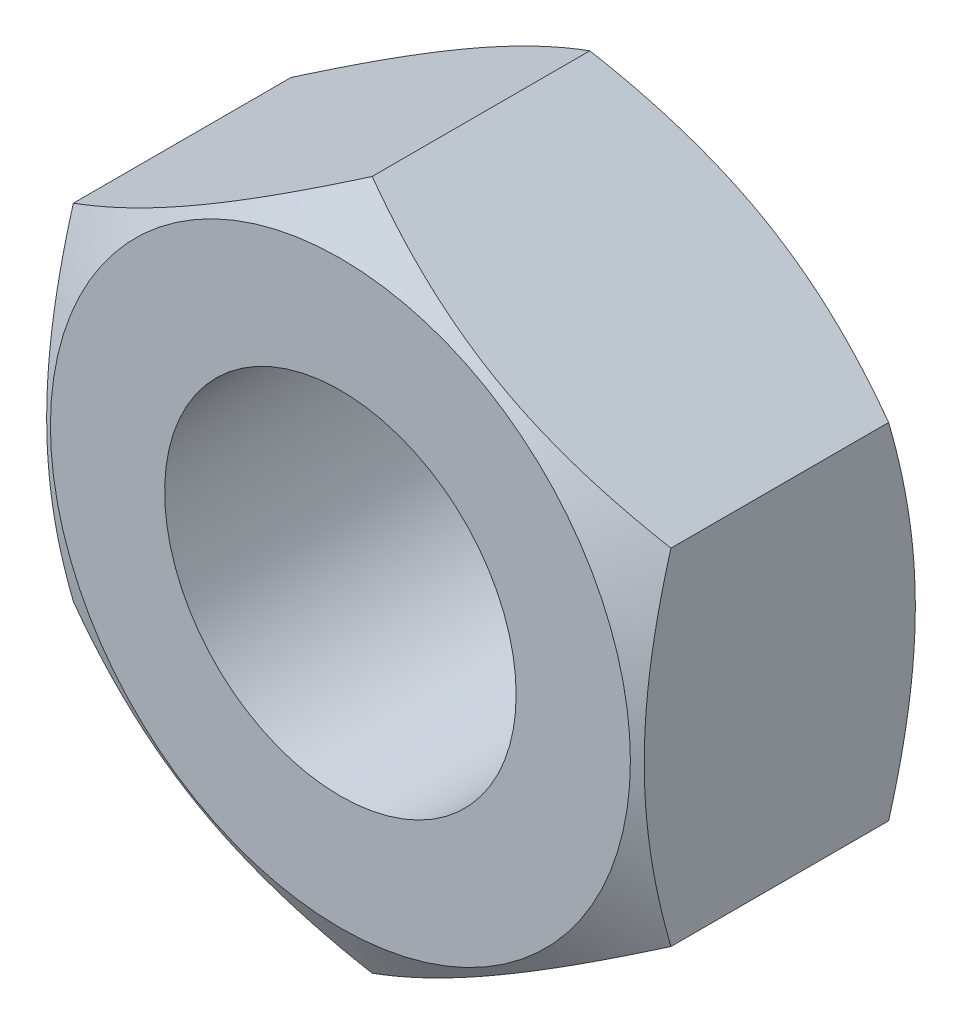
ISO-10303-21;
HEADER;
FILE_DESCRIPTION(('STEP AP214'),'2;1');
FILE_NAME('part.step','',(''),(''),'','','');
FILE_SCHEMA(('AUTOMOTIVE_DESIGN { 1 0 10303 214 1 1 1 1 }'));
ENDSEC;
DATA;
#1=APPLICATION_CONTEXT('core data for automotive mechanical design processes');
#2=APPLICATION_PROTOCOL_DEFINITION('international standard','automotive_design',2000,#1);
#3=PRODUCT_CONTEXT('',#1,'mechanical');
#4=PRODUCT('Part','Part','',(#3));
#5=PRODUCT_RELATED_PRODUCT_CATEGORY('part','',(#4));
#6=PRODUCT_DEFINITION_FORMATION('','',#4);
#7=PRODUCT_DEFINITION_CONTEXT('part definition',#1,'design');
#8=PRODUCT_DEFINITION('design','',#6,#7);
#9=PRODUCT_DEFINITION_SHAPE('','',#8);
#10=(LENGTH_UNIT() NAMED_UNIT(*) SI_UNIT(.MILLI.,.METRE.));
#11=(NAMED_UNIT(*) PLANE_ANGLE_UNIT() SI_UNIT($,.RADIAN.));
#12=(NAMED_UNIT(*) SI_UNIT($,.STERADIAN.) SOLID_ANGLE_UNIT());
#13=UNCERTAINTY_MEASURE_WITH_UNIT(LENGTH_MEASURE(1.E-05),#10,'distance_accuracy_value','');
#14=(GEOMETRIC_REPRESENTATION_CONTEXT(3) GLOBAL_UNCERTAINTY_ASSIGNED_CONTEXT((#13)) GLOBAL_UNIT_ASSIGNED_CONTEXT((#10,
#11,#12)) REPRESENTATION_CONTEXT('',''));
#15=CARTESIAN_POINT('',(0.,0.,0.));
#16=DIRECTION('',(0.,0.,1.));
#17=DIRECTION('',(1.,0.,0.));
#18=AXIS2_PLACEMENT_3D('',#15,#16,#17);
#19=CARTESIAN_POINT('',(-8.5,-4.90747728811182,8.));
#20=DIRECTION('',(-1.,0.,0.));
#21=DIRECTION('',(0.,0.,1.));
#22=AXIS2_PLACEMENT_3D('',#19,#20,#21);
#23=PLANE('',#22);
#24=DIRECTION('',(0.,0.,-1.));
#25=VECTOR('',#24,1.);
#26=CARTESIAN_POINT('',(-8.5,-4.90747728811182,8.));
#27=LINE('',#26,#25);
#28=CARTESIAN_POINT('',(-8.5,-4.90747728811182,7.09647305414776));
#29=VERTEX_POINT('',#28);
#30=CARTESIAN_POINT('',(-8.5,-4.90747728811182,0.903526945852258));
#31=VERTEX_POINT('',#30);
#32=EDGE_CURVE('E9',#29,#31,#27,.T.);
#33=ORIENTED_EDGE('',*,*,#32,.F.);
#34=CARTESIAN_POINT('',(-8.5,-13.0915549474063,3.75131765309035));
#35=CARTESIAN_POINT('',(-8.5,-12.7210522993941,3.93067870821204));
#36=CARTESIAN_POINT('',(-8.5,-12.3496893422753,4.1082935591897));
#37=CARTESIAN_POINT('',(-8.5,-11.6047849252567,4.45904687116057));
#38=CARTESIAN_POINT('',(-8.5,-11.2312431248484,4.63218460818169));
#39=CARTESIAN_POINT('',(-8.5,-10.4795547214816,4.97389023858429));
#40=CARTESIAN_POINT('',(-8.5,-10.1013940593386,5.14242731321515));
#41=CARTESIAN_POINT('',(-8.5,-9.34203313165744,5.47248218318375));
#42=CARTESIAN_POINT('',(-8.5,-8.9608330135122,5.63400031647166));
#43=CARTESIAN_POINT('',(-8.5,-8.18283943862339,5.9530606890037));
#44=CARTESIAN_POINT('',(-8.5,-7.78593021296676,6.11032222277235));
#45=CARTESIAN_POINT('',(-8.5,-6.98743583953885,6.41272243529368));
#46=CARTESIAN_POINT('',(-8.5,-6.58585016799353,6.55785974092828));
#47=CARTESIAN_POINT('',(-8.5,-5.77814054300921,6.83213435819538));
#48=CARTESIAN_POINT('',(-8.5,-5.37202798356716,6.96130485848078));
#49=CARTESIAN_POINT('',(-8.5,-4.55399343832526,7.19944334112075));
#50=CARTESIAN_POINT('',(-8.5,-4.14207335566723,7.30841778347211));
#51=CARTESIAN_POINT('',(-8.5,-3.31438796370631,7.50029341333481));
#52=CARTESIAN_POINT('',(-8.5,-2.89865550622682,7.58333244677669));
#53=CARTESIAN_POINT('',(-8.5,-2.27134456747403,7.68479926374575));
#54=CARTESIAN_POINT('',(-8.5,-2.06160610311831,7.7147743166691));
#55=CARTESIAN_POINT('',(-8.5,-1.64111774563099,7.76643728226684));
#56=CARTESIAN_POINT('',(-8.5,-1.43036795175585,7.78812599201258));
#57=CARTESIAN_POINT('',(-8.5,-1.01085234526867,7.82251681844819));
#58=CARTESIAN_POINT('',(-8.5,-0.802095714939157,7.83533052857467));
#59=CARTESIAN_POINT('',(-8.5,-0.384227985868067,7.85212506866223));
#60=CARTESIAN_POINT('',(-8.5,-0.175116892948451,7.85610604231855));
#61=CARTESIAN_POINT('',(-8.5,0.243087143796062,7.85514037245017));
#62=CARTESIAN_POINT('',(-8.5,0.452180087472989,7.8501936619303));
#63=CARTESIAN_POINT('',(-8.5,0.869974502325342,7.8314917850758));
#64=CARTESIAN_POINT('',(-8.5,1.07867595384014,7.81773618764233));
#65=CARTESIAN_POINT('',(-8.5,1.5830262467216,7.77413845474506));
#66=CARTESIAN_POINT('',(-8.5,1.87830686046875,7.73996282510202));
#67=CARTESIAN_POINT('',(-8.5,2.46661820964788,7.65586131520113));
#68=CARTESIAN_POINT('',(-8.5,2.75964862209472,7.60593321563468));
#69=CARTESIAN_POINT('',(-8.5,3.34320037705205,7.49210307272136));
#70=CARTESIAN_POINT('',(-8.5,3.63371951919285,7.42818985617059));
#71=CARTESIAN_POINT('',(-8.5,4.21181524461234,7.2883344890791));
#72=CARTESIAN_POINT('',(-8.5,4.49939187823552,7.21239254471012));
#73=CARTESIAN_POINT('',(-8.5,5.07786906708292,7.04854333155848));
#74=CARTESIAN_POINT('',(-8.5,5.36870556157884,6.9604114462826));
#75=CARTESIAN_POINT('',(-8.5,5.94751266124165,6.77523902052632));
#76=CARTESIAN_POINT('',(-8.5,6.23548324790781,6.6781984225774));
#77=CARTESIAN_POINT('',(-8.5,6.80870426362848,6.47673202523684));
#78=CARTESIAN_POINT('',(-8.5,7.09395560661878,6.37230881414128));
#79=CARTESIAN_POINT('',(-8.5,7.66210792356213,6.15728629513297));
#80=CARTESIAN_POINT('',(-8.5,7.94500892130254,6.0466870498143));
#81=CARTESIAN_POINT('',(-8.5,8.59684880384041,5.7849583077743));
#82=CARTESIAN_POINT('',(-8.5,8.9650387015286,5.63196657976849));
#83=CARTESIAN_POINT('',(-8.5,9.69841979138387,5.31893770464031));
#84=CARTESIAN_POINT('',(-8.5,10.0636108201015,5.15890017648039));
#85=CARTESIAN_POINT('',(-8.5,10.7915324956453,4.83314821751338));
#86=CARTESIAN_POINT('',(-8.5,11.1542626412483,4.66743266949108));
#87=CARTESIAN_POINT('',(-8.5,11.8775879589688,4.33143376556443));
#88=CARTESIAN_POINT('',(-8.5,12.2381831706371,4.16115049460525));
#89=CARTESIAN_POINT('',(-8.5,12.9579418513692,3.81667492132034));
#90=CARTESIAN_POINT('',(-8.5,13.317103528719,3.64247888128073));
#91=CARTESIAN_POINT('',(-8.5,14.0339093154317,3.29098919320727));
#92=CARTESIAN_POINT('',(-8.5,14.3915534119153,3.11369551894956));
#93=CARTESIAN_POINT('',(-8.5,15.4624766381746,2.57801179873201));
#94=CARTESIAN_POINT('',(-8.5,16.1738327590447,2.21577754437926));
#95=CARTESIAN_POINT('',(-8.5,17.5359107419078,1.5133609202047));
#96=CARTESIAN_POINT('',(-8.5,18.1869224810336,1.17373822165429));
#97=CARTESIAN_POINT('',(-8.5,19.486513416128,0.489824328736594));
#98=CARTESIAN_POINT('',(-8.5,20.1350925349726,0.145532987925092));
#99=CARTESIAN_POINT('',(-8.5,21.4288467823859,-0.545823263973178));
#100=CARTESIAN_POINT('',(-8.5,22.0740263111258,-0.892879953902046));
#101=CARTESIAN_POINT('',(-8.5,23.3628204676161,-1.58980967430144));
#102=CARTESIAN_POINT('',(-8.5,24.0064351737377,-1.93968255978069));
#103=CARTESIAN_POINT('',(-8.5,24.6494692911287,-2.2906121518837));
#104=B_SPLINE_CURVE_WITH_KNOTS('',3,(#34,#35,#36,#37,#38,#39,#40,#41,#42,#43,#44,#45,#46,#47,
#48,#49,#50,#51,#52,#53,#54,#55,#56,#57,#58,#59,#60,#61,#62,#63,#64,#65,#66,#67,#68,#69,#70,#71,
#72,#73,#74,#75,#76,#77,#78,#79,#80,#81,#82,#83,#84,#85,#86,#87,#88,#89,#90,#91,#92,#93,#94,#95,
#96,#97,#98,#99,#100,#101,#102,#103),.UNSPECIFIED.,.F.,.F.,(4,2,2,2,2,2,2,2,2,2,2,2,2,2,2,2,2,2,
2,2,2,2,2,2,2,2,2,2,2,2,2,2,2,2,4),(0.,1.23491770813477,2.47003387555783,3.71202833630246,
4.9539629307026,6.2345954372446,7.51537278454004,8.7934414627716,10.0711006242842,
11.3418487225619,11.9773195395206,12.6127292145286,13.2399967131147,13.867254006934,
14.4945160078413,15.121808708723,16.0130688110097,16.904454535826,17.7965550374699,
18.6886402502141,19.6001588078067,20.5116832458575,21.4228896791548,22.3340868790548,
23.5301212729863,24.7262204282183,25.9225562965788,27.1188699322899,28.3163795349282,
29.5138992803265,31.9086521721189,34.1114570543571,36.3143311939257,38.5121282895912,
40.7098129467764),.UNSPECIFIED.);
#105=CARTESIAN_POINT('',(-8.5,4.90747728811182,7.09647305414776));
#106=VERTEX_POINT('',#105);
#107=EDGE_CURVE('E69',#29,#106,#104,.T.);
#108=ORIENTED_EDGE('',*,*,#107,.T.);
#109=DIRECTION('',(0.,0.,-1.));
#110=VECTOR('',#109,1.);
#111=CARTESIAN_POINT('',(-8.5,4.90747728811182,8.));
#112=LINE('',#111,#110);
#113=CARTESIAN_POINT('',(-8.5,4.90747728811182,0.903526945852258));
#114=VERTEX_POINT('',#113);
#115=EDGE_CURVE('E38',#106,#114,#112,.T.);
#116=ORIENTED_EDGE('',*,*,#115,.T.);
#117=CARTESIAN_POINT('',(-8.5,-13.217348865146,4.30968253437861));
#118=CARTESIAN_POINT('',(-8.5,-12.8458016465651,4.1293073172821));
#119=CARTESIAN_POINT('',(-8.5,-12.4734053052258,3.95065142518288));
#120=CARTESIAN_POINT('',(-8.5,-11.7264629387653,3.59774455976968));
#121=CARTESIAN_POINT('',(-8.5,-11.3519165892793,3.42349427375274));
#122=CARTESIAN_POINT('',(-8.5,-10.598309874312,3.07949578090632));
#123=CARTESIAN_POINT('',(-8.5,-10.2192360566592,2.90977694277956));
#124=CARTESIAN_POINT('',(-8.5,-9.45808580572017,2.57723767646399));
#125=CARTESIAN_POINT('',(-8.5,-9.07600951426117,2.41441692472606));
#126=CARTESIAN_POINT('',(-8.5,-8.29577621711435,2.09234631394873));
#127=CARTESIAN_POINT('',(-8.5,-7.89749985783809,1.93338400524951));
#128=CARTESIAN_POINT('',(-8.5,-7.09630157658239,1.62740499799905));
#129=CARTESIAN_POINT('',(-8.5,-6.69337914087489,1.48038963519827));
#130=CARTESIAN_POINT('',(-8.5,-5.88298561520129,1.20213853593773));
#131=CARTESIAN_POINT('',(-8.5,-5.47552550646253,1.07087115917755));
#132=CARTESIAN_POINT('',(-8.5,-4.65477495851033,0.828303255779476));
#133=CARTESIAN_POINT('',(-8.5,-4.24148638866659,0.716996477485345));
#134=CARTESIAN_POINT('',(-8.5,-3.4110781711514,0.520269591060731));
#135=CARTESIAN_POINT('',(-8.5,-2.99399303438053,0.434707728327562));
#136=CARTESIAN_POINT('',(-8.5,-2.36453907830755,0.329359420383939));
#137=CARTESIAN_POINT('',(-8.5,-2.15406819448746,0.298074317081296));
#138=CARTESIAN_POINT('',(-8.5,-1.7320683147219,0.243781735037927));
#139=CARTESIAN_POINT('',(-8.5,-1.52053942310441,0.220773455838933));
#140=CARTESIAN_POINT('',(-8.5,-1.09948590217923,0.183783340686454));
#141=CARTESIAN_POINT('',(-8.5,-0.889971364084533,0.169687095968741));
#142=CARTESIAN_POINT('',(-8.5,-0.470533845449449,0.150369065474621));
#143=CARTESIAN_POINT('',(-8.5,-0.260610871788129,0.145147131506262));
#144=CARTESIAN_POINT('',(-8.5,0.159267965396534,0.143702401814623));
#145=CARTESIAN_POINT('',(-8.5,0.369223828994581,0.147479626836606));
#146=CARTESIAN_POINT('',(-8.5,0.788788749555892,0.163940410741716));
#147=CARTESIAN_POINT('',(-8.5,0.998397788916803,0.176624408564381));
#148=CARTESIAN_POINT('',(-8.5,1.50108256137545,0.217454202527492));
#149=CARTESIAN_POINT('',(-8.5,1.793827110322,0.249766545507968));
#150=CARTESIAN_POINT('',(-8.5,2.37715285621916,0.330009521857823));
#151=CARTESIAN_POINT('',(-8.5,2.66773375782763,0.377942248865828));
#152=CARTESIAN_POINT('',(-8.5,3.53589346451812,0.542630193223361));
#153=CARTESIAN_POINT('',(-8.5,4.10956801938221,0.680245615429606));
#154=CARTESIAN_POINT('',(-8.5,4.96741250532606,0.919010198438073));
#155=CARTESIAN_POINT('',(-8.5,5.25602859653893,1.00510487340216));
#156=CARTESIAN_POINT('',(-8.5,5.83045786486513,1.18626877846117));
#157=CARTESIAN_POINT('',(-8.5,6.11627102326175,1.28133806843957));
#158=CARTESIAN_POINT('',(-8.5,6.68518369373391,1.47892313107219));
#159=CARTESIAN_POINT('',(-8.5,6.96828405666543,1.58143647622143));
#160=CARTESIAN_POINT('',(-8.5,7.53213698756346,1.79270023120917));
#161=CARTESIAN_POINT('',(-8.5,7.81288958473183,1.90145056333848));
#162=CARTESIAN_POINT('',(-8.5,8.48212780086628,2.1678721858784));
#163=CARTESIAN_POINT('',(-8.5,8.86963833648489,2.32798850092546));
#164=CARTESIAN_POINT('',(-8.5,9.64130597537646,2.65613130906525));
#165=CARTESIAN_POINT('',(-8.5,10.0254628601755,2.82415831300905));
#166=CARTESIAN_POINT('',(-8.5,10.7910586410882,3.16651606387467));
#167=CARTESIAN_POINT('',(-8.5,11.172496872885,3.34084829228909));
#168=CARTESIAN_POINT('',(-8.5,11.9330253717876,3.69452635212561));
#169=CARTESIAN_POINT('',(-8.5,12.3121156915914,3.87387207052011));
#170=CARTESIAN_POINT('',(-8.5,13.0687747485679,4.23683235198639));
#171=CARTESIAN_POINT('',(-8.5,13.4463412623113,4.42045154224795));
#172=CARTESIAN_POINT('',(-8.5,14.1998317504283,4.7910284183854));
#173=CARTESIAN_POINT('',(-8.5,14.5757557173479,4.9779861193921));
#174=CARTESIAN_POINT('',(-8.5,15.7013597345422,5.54291756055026));
#175=CARTESIAN_POINT('',(-8.5,16.448977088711,5.92500052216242));
#176=CARTESIAN_POINT('',(-8.5,17.8763952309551,6.6637998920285));
#177=CARTESIAN_POINT('',(-8.5,18.5565227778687,7.01988783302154));
#178=CARTESIAN_POINT('',(-8.5,19.9142584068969,7.73689269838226));
#179=CARTESIAN_POINT('',(-8.5,20.5918663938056,8.09780980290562));
#180=CARTESIAN_POINT('',(-8.5,21.9433746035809,8.82237697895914));
#181=CARTESIAN_POINT('',(-8.5,22.6172798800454,9.18601763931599));
#182=CARTESIAN_POINT('',(-8.5,23.963483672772,9.91617087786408));
#183=CARTESIAN_POINT('',(-8.5,24.6357822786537,10.2826832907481));
#184=CARTESIAN_POINT('',(-8.5,25.3074917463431,10.6502650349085));
#185=B_SPLINE_CURVE_WITH_KNOTS('',3,(#117,#118,#119,#120,#121,#122,#123,#124,#125,#126,#127,
#128,#129,#130,#131,#132,#133,#134,#135,#136,#137,#138,#139,#140,#141,#142,#143,#144,#145,#146,
#147,#148,#149,#150,#151,#152,#153,#154,#155,#156,#157,#158,#159,#160,#161,#162,#163,#164,#165,
#166,#167,#168,#169,#170,#171,#172,#173,#174,#175,#176,#177,#178,#179,#180,#181,#182,#183,#184),
.UNSPECIFIED.,.F.,.F.,(4,2,2,2,2,2,2,2,2,2,2,2,2,2,2,2,2,2,2,2,2,2,2,2,2,2,2,2,2,2,2,2,2,4),(0.,
1.23906418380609,2.47832048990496,3.7242641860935,4.97014937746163,6.25648329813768,
7.54296084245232,8.82680874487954,10.1102538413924,11.3864970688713,12.0247099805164,
12.6628611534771,13.2926441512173,13.9224166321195,14.5521905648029,15.1819955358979,
16.0650645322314,16.9482519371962,18.7155902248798,19.6190649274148,20.5225456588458,
21.4257330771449,22.3289092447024,23.5866510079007,24.8444741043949,26.1025946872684,
27.3606869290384,28.6202113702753,29.8797415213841,32.3984513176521,34.7015479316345,
37.0047307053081,39.3019924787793,41.599122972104),.UNSPECIFIED.);
#186=EDGE_CURVE('E89',#31,#114,#185,.T.);
#187=ORIENTED_EDGE('',*,*,#186,.F.);
#188=EDGE_LOOP('',(#33,#108,#116,#187));
#189=FACE_BOUND('',#188,.T.);
#190=ADVANCED_FACE('F14',(#189),#23,.T.);
#191=CARTESIAN_POINT('',(-8.5,-4.90747728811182,8.));
#192=DIRECTION('',(0.5,0.866025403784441,0.));
#193=DIRECTION('',(-0.866025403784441,0.5,0.));
#194=AXIS2_PLACEMENT_3D('',#191,#192,#193);
#195=PLANE('',#194);
#196=CARTESIAN_POINT('',(-8.5002,-4.90736181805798,7.09640638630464));
#197=CARTESIAN_POINT('',(-8.31336077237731,-5.01523349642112,7.15867629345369));
#198=CARTESIAN_POINT('',(-8.1258249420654,-5.1235073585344,7.21812013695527));
#199=CARTESIAN_POINT('',(-7.74923024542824,-5.34093440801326,7.33057732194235));
#200=CARTESIAN_POINT('',(-7.56017075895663,-5.45008795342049,7.38358788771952));
#201=CARTESIAN_POINT('',(-6.9899652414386,-5.77929626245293,7.53192904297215));
#202=CARTESIAN_POINT('',(-6.60656835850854,-6.00065055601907,7.61630350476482));
#203=CARTESIAN_POINT('',(-6.03282233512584,-6.33190297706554,7.71524241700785));
#204=CARTESIAN_POINT('',(-5.84418723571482,-6.44081150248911,7.7434272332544));
#205=CARTESIAN_POINT('',(-5.46606397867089,-6.65912106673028,7.7906883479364));
#206=CARTESIAN_POINT('',(-5.27657589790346,-6.76852206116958,7.80976545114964));
#207=CARTESIAN_POINT('',(-4.8972734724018,-6.98751241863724,7.8383276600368));
#208=CARTESIAN_POINT('',(-4.70745974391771,-7.09710142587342,7.84782365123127));
#209=CARTESIAN_POINT('',(-4.32765694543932,-7.31638067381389,7.85702005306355));
#210=CARTESIAN_POINT('',(-4.13766788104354,-7.42607091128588,7.85672076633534));
#211=CARTESIAN_POINT('',(-3.78247698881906,-7.63114046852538,7.8470079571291));
#212=CARTESIAN_POINT('',(-3.6172500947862,-7.72653426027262,7.83877926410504));
#213=CARTESIAN_POINT('',(-3.28718328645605,-7.91709842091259,7.81507319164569));
#214=CARTESIAN_POINT('',(-3.12234339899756,-8.01226877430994,7.7995953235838));
#215=CARTESIAN_POINT('',(-2.62846189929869,-8.29741139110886,7.74265381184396));
#216=CARTESIAN_POINT('',(-2.30029449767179,-8.48687892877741,7.69068937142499));
#217=CARTESIAN_POINT('',(-1.64047857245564,-8.86782383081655,7.56077749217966));
#218=CARTESIAN_POINT('',(-1.30891425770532,-9.05925257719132,7.48227936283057));
#219=CARTESIAN_POINT('',(-0.650730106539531,-9.43925537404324,7.30412109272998));
#220=CARTESIAN_POINT('',(-0.324101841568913,-9.62783429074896,7.20450279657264));
#221=CARTESIAN_POINT('',(0.000200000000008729,-9.81507004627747,7.09640638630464));
#222=B_SPLINE_CURVE_WITH_KNOTS('',3,(#196,#197,#198,#199,#200,#201,#202,#203,#204,#205,#206,
#207,#208,#209,#210,#211,#212,#213,#214,#215,#216,#217,#218,#219,#220,#221),.UNSPECIFIED.,.F.,
.F.,(4,2,2,2,2,2,2,2,2,2,2,2,4),(0.,0.673596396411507,1.34748239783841,2.69805431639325,
3.35679995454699,4.01548737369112,4.67342558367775,5.33134346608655,5.90409556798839,
6.47688628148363,7.62328361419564,8.79510569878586,9.9646274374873),.UNSPECIFIED.);
#223=CARTESIAN_POINT('',(0.,-9.81495457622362,7.09647305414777));
#224=VERTEX_POINT('',#223);
#225=EDGE_CURVE('E77',#29,#224,#222,.T.);
#226=ORIENTED_EDGE('',*,*,#225,.F.);
#227=ORIENTED_EDGE('',*,*,#32,.T.);
#228=CARTESIAN_POINT('',(-8.5002,-4.90736181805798,0.90359361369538));
#229=CARTESIAN_POINT('',(-8.31336077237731,-5.01523349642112,0.841323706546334));
#230=CARTESIAN_POINT('',(-8.1258249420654,-5.1235073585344,0.781879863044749));
#231=CARTESIAN_POINT('',(-7.74923024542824,-5.34093440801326,0.669422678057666));
#232=CARTESIAN_POINT('',(-7.56017075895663,-5.45008795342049,0.616412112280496));
#233=CARTESIAN_POINT('',(-6.9899652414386,-5.77929626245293,0.468070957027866));
#234=CARTESIAN_POINT('',(-6.60656835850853,-6.00065055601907,0.383696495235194));
#235=CARTESIAN_POINT('',(-6.03282233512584,-6.33190297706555,0.284757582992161));
#236=CARTESIAN_POINT('',(-5.84418723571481,-6.44081150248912,0.256572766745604));
#237=CARTESIAN_POINT('',(-5.46606397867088,-6.65912106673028,0.209311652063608));
#238=CARTESIAN_POINT('',(-5.27657589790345,-6.76852206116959,0.190234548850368));
#239=CARTESIAN_POINT('',(-4.89727347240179,-6.98751241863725,0.161672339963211));
#240=CARTESIAN_POINT('',(-4.7074597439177,-7.09710142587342,0.15217634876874));
#241=CARTESIAN_POINT('',(-4.32765694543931,-7.3163806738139,0.14297994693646));
#242=CARTESIAN_POINT('',(-4.13766788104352,-7.42607091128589,0.143279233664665));
#243=CARTESIAN_POINT('',(-3.78247698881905,-7.63114046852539,0.15299204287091));
#244=CARTESIAN_POINT('',(-3.6172500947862,-7.72653426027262,0.161220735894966));
#245=CARTESIAN_POINT('',(-3.28718328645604,-7.9170984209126,0.184926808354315));
#246=CARTESIAN_POINT('',(-3.12234339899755,-8.01226877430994,0.200404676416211));
#247=CARTESIAN_POINT('',(-2.62846189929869,-8.29741139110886,0.257346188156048));
#248=CARTESIAN_POINT('',(-2.30029449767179,-8.48687892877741,0.309310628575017));
#249=CARTESIAN_POINT('',(-1.64047857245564,-8.86782383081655,0.439222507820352));
#250=CARTESIAN_POINT('',(-1.30891425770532,-9.05925257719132,0.517720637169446));
#251=CARTESIAN_POINT('',(-0.650730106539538,-9.43925537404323,0.695878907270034));
#252=CARTESIAN_POINT('',(-0.324101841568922,-9.62783429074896,0.79549720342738));
#253=CARTESIAN_POINT('',(0.000199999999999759,-9.81507004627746,0.903593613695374));
#254=B_SPLINE_CURVE_WITH_KNOTS('',3,(#228,#229,#230,#231,#232,#233,#234,#235,#236,#237,#238,
#239,#240,#241,#242,#243,#244,#245,#246,#247,#248,#249,#250,#251,#252,#253),.UNSPECIFIED.,.F.,
.F.,(4,2,2,2,2,2,2,2,2,2,2,2,4),(0.,0.673596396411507,1.34748239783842,2.69805431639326,
3.356799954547,4.01548737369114,4.67342558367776,5.33134346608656,5.9040955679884,
6.47688628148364,7.62328361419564,8.79510569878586,9.96462743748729),.UNSPECIFIED.);
#255=CARTESIAN_POINT('',(0.,-9.81495457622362,0.903526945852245));
#256=VERTEX_POINT('',#255);
#257=EDGE_CURVE('E111',#31,#256,#254,.T.);
#258=ORIENTED_EDGE('',*,*,#257,.T.);
#259=DIRECTION('',(0.,0.,-1.));
#260=VECTOR('',#259,1.);
#261=CARTESIAN_POINT('',(0.,-9.81495457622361,8.));
#262=LINE('',#261,#260);
#263=EDGE_CURVE('E23',#224,#256,#262,.T.);
#264=ORIENTED_EDGE('',*,*,#263,.F.);
#265=EDGE_LOOP('',(#226,#227,#258,#264));
#266=FACE_BOUND('',#265,.T.);
#267=ADVANCED_FACE('F16',(#266),#195,.F.);
#268=CARTESIAN_POINT('',(8.5,-4.90747728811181,8.));
#269=DIRECTION('',(0.5,-0.86602540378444,0.));
#270=DIRECTION('',(0.86602540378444,0.5,0.));
#271=AXIS2_PLACEMENT_3D('',#268,#269,#270);
#272=PLANE('',#271);
#273=DIRECTION('',(0.,0.,-1.));
#274=VECTOR('',#273,1.);
#275=CARTESIAN_POINT('',(8.5,-4.90747728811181,8.));
#276=LINE('',#275,#274);
#277=CARTESIAN_POINT('',(8.5,-4.90747728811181,7.09647305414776));
#278=VERTEX_POINT('',#277);
#279=CARTESIAN_POINT('',(8.5,-4.90747728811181,0.903526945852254));
#280=VERTEX_POINT('',#279);
#281=EDGE_CURVE('E94',#278,#280,#276,.T.);
#282=ORIENTED_EDGE('',*,*,#281,.F.);
#283=CARTESIAN_POINT('',(8.5002,-4.90736181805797,7.09640638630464));
#284=CARTESIAN_POINT('',(8.31336077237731,-5.01523349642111,7.15867629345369));
#285=CARTESIAN_POINT('',(8.1258249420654,-5.12350735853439,7.21812013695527));
#286=CARTESIAN_POINT('',(7.74923024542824,-5.34093440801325,7.33057732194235));
#287=CARTESIAN_POINT('',(7.56017075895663,-5.45008795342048,7.38358788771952));
#288=CARTESIAN_POINT('',(6.9899652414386,-5.77929626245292,7.53192904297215));
#289=CARTESIAN_POINT('',(6.60656835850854,-6.00065055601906,7.61630350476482));
#290=CARTESIAN_POINT('',(6.03282233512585,-6.33190297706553,7.71524241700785));
#291=CARTESIAN_POINT('',(5.84418723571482,-6.4408115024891,7.74342723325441));
#292=CARTESIAN_POINT('',(5.4660639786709,-6.65912106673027,7.7906883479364));
#293=CARTESIAN_POINT('',(5.27657589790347,-6.76852206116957,7.80976545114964));
#294=CARTESIAN_POINT('',(4.89727347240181,-6.98751241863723,7.8383276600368));
#295=CARTESIAN_POINT('',(4.70745974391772,-7.09710142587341,7.84782365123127));
#296=CARTESIAN_POINT('',(4.32765694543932,-7.31638067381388,7.85702005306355));
#297=CARTESIAN_POINT('',(4.13766788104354,-7.42607091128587,7.85672076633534));
#298=CARTESIAN_POINT('',(3.78247698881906,-7.63114046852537,7.8470079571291));
#299=CARTESIAN_POINT('',(3.61725009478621,-7.72653426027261,7.83877926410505));
#300=CARTESIAN_POINT('',(3.28718328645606,-7.91709842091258,7.8150731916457));
#301=CARTESIAN_POINT('',(3.12234339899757,-8.01226877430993,7.7995953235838));
#302=CARTESIAN_POINT('',(2.6284618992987,-8.29741139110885,7.74265381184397));
#303=CARTESIAN_POINT('',(2.3002944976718,-8.4868789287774,7.690689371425));
#304=CARTESIAN_POINT('',(1.64047857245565,-8.86782383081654,7.56077749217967));
#305=CARTESIAN_POINT('',(1.30891425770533,-9.05925257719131,7.48227936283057));
#306=CARTESIAN_POINT('',(0.650730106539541,-9.43925537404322,7.30412109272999));
#307=CARTESIAN_POINT('',(0.324101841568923,-9.62783429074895,7.20450279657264));
#308=CARTESIAN_POINT('',(-0.000199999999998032,-9.81507004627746,7.09640638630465));
#309=B_SPLINE_CURVE_WITH_KNOTS('',3,(#283,#284,#285,#286,#287,#288,#289,#290,#291,#292,#293,
#294,#295,#296,#297,#298,#299,#300,#301,#302,#303,#304,#305,#306,#307,#308),.UNSPECIFIED.,.F.,
.F.,(4,2,2,2,2,2,2,2,2,2,2,2,4),(0.,0.673596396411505,1.34748239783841,2.69805431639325,
3.35679995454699,4.01548737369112,4.67342558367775,5.33134346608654,5.90409556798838,
6.47688628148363,7.62328361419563,8.79510569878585,9.96462743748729),.UNSPECIFIED.);
#310=EDGE_CURVE('E103',#278,#224,#309,.T.);
#311=ORIENTED_EDGE('',*,*,#310,.T.);
#312=ORIENTED_EDGE('',*,*,#263,.T.);
#313=CARTESIAN_POINT('',(8.5002,-4.90736181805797,0.903593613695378));
#314=CARTESIAN_POINT('',(8.31336077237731,-5.01523349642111,0.841323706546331));
#315=CARTESIAN_POINT('',(8.1258249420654,-5.12350735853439,0.781879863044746));
#316=CARTESIAN_POINT('',(7.74923024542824,-5.34093440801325,0.669422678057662));
#317=CARTESIAN_POINT('',(7.56017075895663,-5.45008795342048,0.616412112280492));
#318=CARTESIAN_POINT('',(6.9899652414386,-5.77929626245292,0.468070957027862));
#319=CARTESIAN_POINT('',(6.60656835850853,-6.00065055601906,0.38369649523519));
#320=CARTESIAN_POINT('',(6.03282233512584,-6.33190297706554,0.284757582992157));
#321=CARTESIAN_POINT('',(5.84418723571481,-6.44081150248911,0.2565727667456));
#322=CARTESIAN_POINT('',(5.46606397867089,-6.65912106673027,0.209311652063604));
#323=CARTESIAN_POINT('',(5.27657589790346,-6.76852206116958,0.190234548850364));
#324=CARTESIAN_POINT('',(4.8972734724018,-6.98751241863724,0.161672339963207));
#325=CARTESIAN_POINT('',(4.7074597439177,-7.09710142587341,0.152176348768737));
#326=CARTESIAN_POINT('',(4.32765694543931,-7.31638067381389,0.142979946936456));
#327=CARTESIAN_POINT('',(4.13766788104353,-7.42607091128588,0.143279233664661));
#328=CARTESIAN_POINT('',(3.78247698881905,-7.63114046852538,0.152992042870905));
#329=CARTESIAN_POINT('',(3.6172500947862,-7.72653426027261,0.161220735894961));
#330=CARTESIAN_POINT('',(3.28718328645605,-7.91709842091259,0.18492680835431));
#331=CARTESIAN_POINT('',(3.12234339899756,-8.01226877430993,0.200404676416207));
#332=CARTESIAN_POINT('',(2.62846189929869,-8.29741139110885,0.257346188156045));
#333=CARTESIAN_POINT('',(2.30029449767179,-8.4868789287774,0.309310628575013));
#334=CARTESIAN_POINT('',(1.64047857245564,-8.86782383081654,0.439222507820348));
#335=CARTESIAN_POINT('',(1.30891425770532,-9.05925257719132,0.517720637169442));
#336=CARTESIAN_POINT('',(0.650730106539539,-9.43925537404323,0.695878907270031));
#337=CARTESIAN_POINT('',(0.324101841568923,-9.62783429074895,0.795497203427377));
#338=CARTESIAN_POINT('',(-0.000199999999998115,-9.81507004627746,0.903593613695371));
#339=B_SPLINE_CURVE_WITH_KNOTS('',3,(#313,#314,#315,#316,#317,#318,#319,#320,#321,#322,#323,
#324,#325,#326,#327,#328,#329,#330,#331,#332,#333,#334,#335,#336,#337,#338),.UNSPECIFIED.,.F.,
.F.,(4,2,2,2,2,2,2,2,2,2,2,2,4),(0.,0.673596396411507,1.34748239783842,2.69805431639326,
3.356799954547,4.01548737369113,4.67342558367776,5.33134346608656,5.9040955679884,
6.47688628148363,7.62328361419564,8.79510569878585,9.96462743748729),.UNSPECIFIED.);
#340=EDGE_CURVE('E102',#280,#256,#339,.T.);
#341=ORIENTED_EDGE('',*,*,#340,.F.);
#342=EDGE_LOOP('',(#282,#311,#312,#341));
#343=FACE_BOUND('',#342,.T.);
#344=ADVANCED_FACE('F101',(#343),#272,.T.);
#345=CARTESIAN_POINT('',(8.5,-4.90747728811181,8.));
#346=DIRECTION('',(-1.,0.,0.));
#347=DIRECTION('',(0.,0.,1.));
#348=AXIS2_PLACEMENT_3D('',#345,#346,#347);
#349=PLANE('',#348);
#350=CARTESIAN_POINT('',(8.5,-13.0915549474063,3.75131765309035));
#351=CARTESIAN_POINT('',(8.5,-12.7210522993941,3.93067870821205));
#352=CARTESIAN_POINT('',(8.5,-12.3496893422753,4.10829355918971));
#353=CARTESIAN_POINT('',(8.5,-11.6047849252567,4.45904687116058));
#354=CARTESIAN_POINT('',(8.5,-11.2312431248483,4.63218460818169));
#355=CARTESIAN_POINT('',(8.5,-10.4795547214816,4.9738902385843));
#356=CARTESIAN_POINT('',(8.5,-10.1013940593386,5.14242731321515));
#357=CARTESIAN_POINT('',(8.5,-9.34203313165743,5.47248218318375));
#358=CARTESIAN_POINT('',(8.5,-8.96083301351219,5.63400031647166));
#359=CARTESIAN_POINT('',(8.5,-8.18283943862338,5.9530606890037));
#360=CARTESIAN_POINT('',(8.5,-7.78593021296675,6.11032222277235));
#361=CARTESIAN_POINT('',(8.5,-6.98743583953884,6.41272243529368));
#362=CARTESIAN_POINT('',(8.5,-6.58585016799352,6.55785974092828));
#363=CARTESIAN_POINT('',(8.5,-5.7781405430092,6.83213435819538));
#364=CARTESIAN_POINT('',(8.5,-5.37202798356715,6.96130485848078));
#365=CARTESIAN_POINT('',(8.5,-4.55399343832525,7.19944334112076));
#366=CARTESIAN_POINT('',(8.5,-4.14207335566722,7.30841778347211));
#367=CARTESIAN_POINT('',(8.5,-3.31438796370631,7.50029341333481));
#368=CARTESIAN_POINT('',(8.5,-2.89865550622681,7.58333244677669));
#369=CARTESIAN_POINT('',(8.5,-2.27134456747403,7.68479926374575));
#370=CARTESIAN_POINT('',(8.5,-2.0616061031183,7.7147743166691));
#371=CARTESIAN_POINT('',(8.5,-1.64111774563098,7.76643728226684));
#372=CARTESIAN_POINT('',(8.5,-1.43036795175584,7.78812599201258));
#373=CARTESIAN_POINT('',(8.5,-1.01085234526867,7.82251681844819));
#374=CARTESIAN_POINT('',(8.5,-0.802095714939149,7.83533052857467));
#375=CARTESIAN_POINT('',(8.5,-0.384227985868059,7.85212506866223));
#376=CARTESIAN_POINT('',(8.5,-0.175116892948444,7.85610604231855));
#377=CARTESIAN_POINT('',(8.5,0.243087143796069,7.85514037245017));
#378=CARTESIAN_POINT('',(8.5,0.452180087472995,7.8501936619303));
#379=CARTESIAN_POINT('',(8.5,0.869974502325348,7.8314917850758));
#380=CARTESIAN_POINT('',(8.5,1.07867595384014,7.81773618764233));
#381=CARTESIAN_POINT('',(8.5,1.58302624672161,7.77413845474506));
#382=CARTESIAN_POINT('',(8.5,1.87830686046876,7.73996282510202));
#383=CARTESIAN_POINT('',(8.5,2.46661820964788,7.65586131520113));
#384=CARTESIAN_POINT('',(8.5,2.75964862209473,7.60593321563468));
#385=CARTESIAN_POINT('',(8.5,3.34320037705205,7.49210307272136));
#386=CARTESIAN_POINT('',(8.5,3.63371951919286,7.42818985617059));
#387=CARTESIAN_POINT('',(8.5,4.21181524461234,7.2883344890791));
#388=CARTESIAN_POINT('',(8.5,4.49939187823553,7.21239254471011));
#389=CARTESIAN_POINT('',(8.5,5.07786906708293,7.04854333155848));
#390=CARTESIAN_POINT('',(8.5,5.36870556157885,6.96041144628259));
#391=CARTESIAN_POINT('',(8.5,5.94751266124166,6.77523902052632));
#392=CARTESIAN_POINT('',(8.5,6.23548324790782,6.67819842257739));
#393=CARTESIAN_POINT('',(8.5,6.80870426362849,6.47673202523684));
#394=CARTESIAN_POINT('',(8.5,7.09395560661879,6.37230881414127));
#395=CARTESIAN_POINT('',(8.5,7.66210792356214,6.15728629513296));
#396=CARTESIAN_POINT('',(8.5,7.94500892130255,6.04668704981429));
#397=CARTESIAN_POINT('',(8.5,8.59684880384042,5.78495830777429));
#398=CARTESIAN_POINT('',(8.5,8.96503870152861,5.63196657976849));
#399=CARTESIAN_POINT('',(8.5,9.69841979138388,5.31893770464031));
#400=CARTESIAN_POINT('',(8.5,10.0636108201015,5.15890017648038));
#401=CARTESIAN_POINT('',(8.5,10.7915324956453,4.83314821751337));
#402=CARTESIAN_POINT('',(8.5,11.1542626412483,4.66743266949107));
#403=CARTESIAN_POINT('',(8.5,11.8775879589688,4.33143376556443));
#404=CARTESIAN_POINT('',(8.5,12.2381831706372,4.16115049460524));
#405=CARTESIAN_POINT('',(8.5,12.9579418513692,3.81667492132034));
#406=CARTESIAN_POINT('',(8.5,13.317103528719,3.64247888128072));
#407=CARTESIAN_POINT('',(8.5,14.0339093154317,3.29098919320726));
#408=CARTESIAN_POINT('',(8.5,14.3915534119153,3.11369551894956));
#409=CARTESIAN_POINT('',(8.5,15.4624766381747,2.578011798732));
#410=CARTESIAN_POINT('',(8.5,16.1738327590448,2.21577754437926));
#411=CARTESIAN_POINT('',(8.5,17.5359107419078,1.5133609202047));
#412=CARTESIAN_POINT('',(8.5,18.1869224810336,1.17373822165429));
#413=CARTESIAN_POINT('',(8.5,19.486513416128,0.48982432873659));
#414=CARTESIAN_POINT('',(8.5,20.1350925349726,0.14553298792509));
#415=CARTESIAN_POINT('',(8.5,21.4288467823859,-0.545823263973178));
#416=CARTESIAN_POINT('',(8.5,22.0740263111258,-0.892879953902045));
#417=CARTESIAN_POINT('',(8.5,23.3628204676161,-1.58980967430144));
#418=CARTESIAN_POINT('',(8.5,24.0064351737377,-1.93968255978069));
#419=CARTESIAN_POINT('',(8.5,24.6494692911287,-2.2906121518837));
#420=B_SPLINE_CURVE_WITH_KNOTS('',3,(#350,#351,#352,#353,#354,#355,#356,#357,#358,#359,#360,
#361,#362,#363,#364,#365,#366,#367,#368,#369,#370,#371,#372,#373,#374,#375,#376,#377,#378,#379,
#380,#381,#382,#383,#384,#385,#386,#387,#388,#389,#390,#391,#392,#393,#394,#395,#396,#397,#398,
#399,#400,#401,#402,#403,#404,#405,#406,#407,#408,#409,#410,#411,#412,#413,#414,#415,#416,#417,
#418,#419),.UNSPECIFIED.,.F.,.F.,(4,2,2,2,2,2,2,2,2,2,2,2,2,2,2,2,2,2,2,2,2,2,2,2,2,2,2,2,2,2,2,
2,2,2,4),(0.,1.23491770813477,2.47003387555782,3.71202833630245,4.95396293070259,
6.23459543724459,7.51537278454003,8.79344146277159,10.0711006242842,11.3418487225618,
11.9773195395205,12.6127292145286,13.2399967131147,13.867254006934,14.4945160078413,
15.121808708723,16.0130688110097,16.904454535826,17.7965550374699,18.6886402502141,
19.6001588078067,20.5116832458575,21.4228896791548,22.3340868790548,23.5301212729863,
24.7262204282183,25.9225562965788,27.1188699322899,28.3163795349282,29.5138992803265,
31.9086521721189,34.1114570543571,36.3143311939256,38.5121282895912,40.7098129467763),.UNSPECIFIED.);
#421=CARTESIAN_POINT('',(8.5,4.90747728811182,7.09647305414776));
#422=VERTEX_POINT('',#421);
#423=EDGE_CURVE('E173',#278,#422,#420,.T.);
#424=ORIENTED_EDGE('',*,*,#423,.F.);
#425=ORIENTED_EDGE('',*,*,#281,.T.);
#426=CARTESIAN_POINT('',(8.5,-13.217348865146,4.3096825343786));
#427=CARTESIAN_POINT('',(8.5,-12.8458016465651,4.1293073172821));
#428=CARTESIAN_POINT('',(8.5,-12.4734053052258,3.95065142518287));
#429=CARTESIAN_POINT('',(8.5,-11.7264629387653,3.59774455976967));
#430=CARTESIAN_POINT('',(8.5,-11.3519165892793,3.42349427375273));
#431=CARTESIAN_POINT('',(8.5,-10.5983098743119,3.07949578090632));
#432=CARTESIAN_POINT('',(8.5,-10.2192360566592,2.90977694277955));
#433=CARTESIAN_POINT('',(8.5,-9.45808580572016,2.57723767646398));
#434=CARTESIAN_POINT('',(8.5,-9.07600951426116,2.41441692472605));
#435=CARTESIAN_POINT('',(8.5,-8.29577621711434,2.09234631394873));
#436=CARTESIAN_POINT('',(8.5,-7.89749985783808,1.9333840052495));
#437=CARTESIAN_POINT('',(8.5,-7.09630157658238,1.62740499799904));
#438=CARTESIAN_POINT('',(8.5,-6.69337914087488,1.48038963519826));
#439=CARTESIAN_POINT('',(8.5,-5.88298561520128,1.20213853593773));
#440=CARTESIAN_POINT('',(8.5,-5.47552550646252,1.07087115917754));
#441=CARTESIAN_POINT('',(8.5,-4.65477495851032,0.828303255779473));
#442=CARTESIAN_POINT('',(8.5,-4.24148638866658,0.716996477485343));
#443=CARTESIAN_POINT('',(8.5,-3.41107817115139,0.520269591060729));
#444=CARTESIAN_POINT('',(8.5,-2.99399303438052,0.43470772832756));
#445=CARTESIAN_POINT('',(8.5,-2.36453907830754,0.329359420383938));
#446=CARTESIAN_POINT('',(8.5,-2.15406819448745,0.298074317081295));
#447=CARTESIAN_POINT('',(8.5,-1.73206831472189,0.243781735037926));
#448=CARTESIAN_POINT('',(8.5,-1.5205394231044,0.220773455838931));
#449=CARTESIAN_POINT('',(8.5,-1.09948590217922,0.183783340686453));
#450=CARTESIAN_POINT('',(8.5,-0.889971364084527,0.169687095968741));
#451=CARTESIAN_POINT('',(8.5,-0.470533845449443,0.150369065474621));
#452=CARTESIAN_POINT('',(8.5,-0.260610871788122,0.145147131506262));
#453=CARTESIAN_POINT('',(8.5,0.159267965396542,0.143702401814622));
#454=CARTESIAN_POINT('',(8.5,0.36922382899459,0.147479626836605));
#455=CARTESIAN_POINT('',(8.5,0.7887887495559,0.163940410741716));
#456=CARTESIAN_POINT('',(8.5,0.998397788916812,0.176624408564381));
#457=CARTESIAN_POINT('',(8.5,1.50108256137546,0.217454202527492));
#458=CARTESIAN_POINT('',(8.5,1.79382711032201,0.249766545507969));
#459=CARTESIAN_POINT('',(8.5,2.37715285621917,0.330009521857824));
#460=CARTESIAN_POINT('',(8.5,2.66773375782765,0.377942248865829));
#461=CARTESIAN_POINT('',(8.5,3.53589346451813,0.542630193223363));
#462=CARTESIAN_POINT('',(8.5,4.10956801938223,0.680245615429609));
#463=CARTESIAN_POINT('',(8.5,4.96741250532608,0.919010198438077));
#464=CARTESIAN_POINT('',(8.5,5.25602859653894,1.00510487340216));
#465=CARTESIAN_POINT('',(8.5,5.83045786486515,1.18626877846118));
#466=CARTESIAN_POINT('',(8.5,6.11627102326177,1.28133806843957));
#467=CARTESIAN_POINT('',(8.5,6.68518369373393,1.4789231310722));
#468=CARTESIAN_POINT('',(8.5,6.96828405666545,1.58143647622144));
#469=CARTESIAN_POINT('',(8.5,7.53213698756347,1.79270023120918));
#470=CARTESIAN_POINT('',(8.5,7.81288958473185,1.90145056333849));
#471=CARTESIAN_POINT('',(8.5,8.4821278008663,2.1678721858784));
#472=CARTESIAN_POINT('',(8.5,8.86963833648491,2.32798850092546));
#473=CARTESIAN_POINT('',(8.5,9.64130597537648,2.65613130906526));
#474=CARTESIAN_POINT('',(8.5,10.0254628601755,2.82415831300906));
#475=CARTESIAN_POINT('',(8.5,10.7910586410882,3.16651606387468));
#476=CARTESIAN_POINT('',(8.5,11.172496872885,3.3408482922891));
#477=CARTESIAN_POINT('',(8.5,11.9330253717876,3.69452635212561));
#478=CARTESIAN_POINT('',(8.5,12.3121156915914,3.87387207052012));
#479=CARTESIAN_POINT('',(8.5,13.068774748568,4.2368323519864));
#480=CARTESIAN_POINT('',(8.5,13.4463412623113,4.42045154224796));
#481=CARTESIAN_POINT('',(8.5,14.1998317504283,4.79102841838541));
#482=CARTESIAN_POINT('',(8.5,14.5757557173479,4.9779861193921));
#483=CARTESIAN_POINT('',(8.5,15.7013597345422,5.54291756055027));
#484=CARTESIAN_POINT('',(8.5,16.448977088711,5.92500052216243));
#485=CARTESIAN_POINT('',(8.5,17.8763952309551,6.6637998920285));
#486=CARTESIAN_POINT('',(8.5,18.5565227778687,7.01988783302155));
#487=CARTESIAN_POINT('',(8.5,19.9142584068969,7.73689269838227));
#488=CARTESIAN_POINT('',(8.5,20.5918663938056,8.09780980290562));
#489=CARTESIAN_POINT('',(8.5,21.9433746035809,8.82237697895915));
#490=CARTESIAN_POINT('',(8.5,22.6172798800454,9.186017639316));
#491=CARTESIAN_POINT('',(8.5,23.963483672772,9.91617087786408));
#492=CARTESIAN_POINT('',(8.5,24.6357822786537,10.2826832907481));
#493=CARTESIAN_POINT('',(8.5,25.3074917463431,10.6502650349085));
#494=B_SPLINE_CURVE_WITH_KNOTS('',3,(#426,#427,#428,#429,#430,#431,#432,#433,#434,#435,#436,
#437,#438,#439,#440,#441,#442,#443,#444,#445,#446,#447,#448,#449,#450,#451,#452,#453,#454,#455,
#456,#457,#458,#459,#460,#461,#462,#463,#464,#465,#466,#467,#468,#469,#470,#471,#472,#473,#474,
#475,#476,#477,#478,#479,#480,#481,#482,#483,#484,#485,#486,#487,#488,#489,#490,#491,#492,#493),
.UNSPECIFIED.,.F.,.F.,(4,2,2,2,2,2,2,2,2,2,2,2,2,2,2,2,2,2,2,2,2,2,2,2,2,2,2,2,2,2,2,2,2,4),(0.,
1.23906418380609,2.47832048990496,3.72426418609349,4.97014937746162,6.25648329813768,
7.54296084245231,8.82680874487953,10.1102538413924,11.3864970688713,12.0247099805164,
12.6628611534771,13.2926441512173,13.9224166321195,14.5521905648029,15.1819955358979,
16.0650645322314,16.9482519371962,18.7155902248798,19.6190649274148,20.5225456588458,
21.4257330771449,22.3289092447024,23.5866510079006,24.8444741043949,26.1025946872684,
27.3606869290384,28.6202113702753,29.8797415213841,32.3984513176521,34.7015479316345,
37.0047307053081,39.3019924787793,41.599122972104),.UNSPECIFIED.);
#495=CARTESIAN_POINT('',(8.5,4.90747728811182,0.903526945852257));
#496=VERTEX_POINT('',#495);
#497=EDGE_CURVE('E114',#280,#496,#494,.T.);
#498=ORIENTED_EDGE('',*,*,#497,.T.);
#499=DIRECTION('',(0.,0.,-1.));
#500=VECTOR('',#499,1.);
#501=CARTESIAN_POINT('',(8.5,4.90747728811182,8.));
#502=LINE('',#501,#500);
#503=EDGE_CURVE('E86',#422,#496,#502,.T.);
#504=ORIENTED_EDGE('',*,*,#503,.F.);
#505=EDGE_LOOP('',(#424,#425,#498,#504));
#506=FACE_BOUND('',#505,.T.);
#507=ADVANCED_FACE('F164',(#506),#349,.F.);
#508=CARTESIAN_POINT('',(8.5,4.90747728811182,8.));
#509=DIRECTION('',(-0.5,-0.86602540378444,0.));
#510=DIRECTION('',(0.86602540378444,-0.5,0.));
#511=AXIS2_PLACEMENT_3D('',#508,#509,#510);
#512=PLANE('',#511);
#513=CARTESIAN_POINT('',(8.5002,4.90736181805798,7.09640638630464));
#514=CARTESIAN_POINT('',(8.31336077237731,5.01523349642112,7.15867629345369));
#515=CARTESIAN_POINT('',(8.1258249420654,5.1235073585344,7.21812013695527));
#516=CARTESIAN_POINT('',(7.74923024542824,5.34093440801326,7.33057732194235));
#517=CARTESIAN_POINT('',(7.56017075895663,5.45008795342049,7.38358788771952));
#518=CARTESIAN_POINT('',(6.9899652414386,5.77929626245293,7.53192904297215));
#519=CARTESIAN_POINT('',(6.60656835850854,6.00065055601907,7.61630350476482));
#520=CARTESIAN_POINT('',(6.03282233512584,6.33190297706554,7.71524241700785));
#521=CARTESIAN_POINT('',(5.84418723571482,6.44081150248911,7.7434272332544));
#522=CARTESIAN_POINT('',(5.4660639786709,6.65912106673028,7.7906883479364));
#523=CARTESIAN_POINT('',(5.27657589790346,6.76852206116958,7.80976545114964));
#524=CARTESIAN_POINT('',(4.8972734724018,6.98751241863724,7.8383276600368));
#525=CARTESIAN_POINT('',(4.70745974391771,7.09710142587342,7.84782365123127));
#526=CARTESIAN_POINT('',(4.32765694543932,7.31638067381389,7.85702005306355));
#527=CARTESIAN_POINT('',(4.13766788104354,7.42607091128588,7.85672076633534));
#528=CARTESIAN_POINT('',(3.78247698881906,7.63114046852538,7.8470079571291));
#529=CARTESIAN_POINT('',(3.61725009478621,7.72653426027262,7.83877926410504));
#530=CARTESIAN_POINT('',(3.28718328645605,7.9170984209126,7.81507319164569));
#531=CARTESIAN_POINT('',(3.12234339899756,8.01226877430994,7.7995953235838));
#532=CARTESIAN_POINT('',(2.62846189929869,8.29741139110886,7.74265381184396));
#533=CARTESIAN_POINT('',(2.30029449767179,8.48687892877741,7.69068937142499));
#534=CARTESIAN_POINT('',(1.64047857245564,8.86782383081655,7.56077749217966));
#535=CARTESIAN_POINT('',(1.30891425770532,9.05925257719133,7.48227936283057));
#536=CARTESIAN_POINT('',(0.650730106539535,9.43925537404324,7.30412109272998));
#537=CARTESIAN_POINT('',(0.324101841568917,9.62783429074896,7.20450279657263));
#538=CARTESIAN_POINT('',(-0.00020000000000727,9.81507004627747,7.09640638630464));
#539=B_SPLINE_CURVE_WITH_KNOTS('',3,(#513,#514,#515,#516,#517,#518,#519,#520,#521,#522,#523,
#524,#525,#526,#527,#528,#529,#530,#531,#532,#533,#534,#535,#536,#537,#538),.UNSPECIFIED.,.F.,
.F.,(4,2,2,2,2,2,2,2,2,2,2,2,4),(0.,0.673596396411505,1.34748239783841,2.69805431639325,
3.35679995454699,4.01548737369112,4.67342558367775,5.33134346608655,5.90409556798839,
6.47688628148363,7.62328361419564,8.79510569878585,9.9646274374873),.UNSPECIFIED.);
#540=CARTESIAN_POINT('',(0.,9.81495457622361,7.09647305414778));
#541=VERTEX_POINT('',#540);
#542=EDGE_CURVE('E30',#422,#541,#539,.T.);
#543=ORIENTED_EDGE('',*,*,#542,.F.);
#544=ORIENTED_EDGE('',*,*,#503,.T.);
#545=CARTESIAN_POINT('',(8.5002,4.90736181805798,0.90359361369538));
#546=CARTESIAN_POINT('',(8.31336077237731,5.01523349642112,0.841323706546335));
#547=CARTESIAN_POINT('',(8.1258249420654,5.1235073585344,0.78187986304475));
#548=CARTESIAN_POINT('',(7.74923024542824,5.34093440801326,0.669422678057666));
#549=CARTESIAN_POINT('',(7.56017075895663,5.45008795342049,0.616412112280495));
#550=CARTESIAN_POINT('',(6.9899652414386,5.77929626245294,0.468070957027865));
#551=CARTESIAN_POINT('',(6.60656835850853,6.00065055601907,0.383696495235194));
#552=CARTESIAN_POINT('',(6.03282233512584,6.33190297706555,0.284757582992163));
#553=CARTESIAN_POINT('',(5.84418723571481,6.44081150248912,0.256572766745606));
#554=CARTESIAN_POINT('',(5.46606397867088,6.65912106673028,0.209311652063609));
#555=CARTESIAN_POINT('',(5.27657589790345,6.76852206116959,0.190234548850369));
#556=CARTESIAN_POINT('',(4.89727347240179,6.98751241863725,0.161672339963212));
#557=CARTESIAN_POINT('',(4.7074597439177,7.09710142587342,0.152176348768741));
#558=CARTESIAN_POINT('',(4.32765694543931,7.3163806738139,0.142979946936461));
#559=CARTESIAN_POINT('',(4.13766788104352,7.42607091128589,0.143279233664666));
#560=CARTESIAN_POINT('',(3.78247698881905,7.63114046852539,0.152992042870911));
#561=CARTESIAN_POINT('',(3.6172500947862,7.72653426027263,0.161220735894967));
#562=CARTESIAN_POINT('',(3.28718328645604,7.9170984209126,0.184926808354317));
#563=CARTESIAN_POINT('',(3.12234339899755,8.01226877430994,0.200404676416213));
#564=CARTESIAN_POINT('',(2.62846189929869,8.29741139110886,0.25734618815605));
#565=CARTESIAN_POINT('',(2.30029449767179,8.48687892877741,0.309310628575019));
#566=CARTESIAN_POINT('',(1.64047857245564,8.86782383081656,0.439222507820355));
#567=CARTESIAN_POINT('',(1.30891425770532,9.05925257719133,0.517720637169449));
#568=CARTESIAN_POINT('',(0.650730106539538,9.43925537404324,0.695878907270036));
#569=CARTESIAN_POINT('',(0.324101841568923,9.62783429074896,0.795497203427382));
#570=CARTESIAN_POINT('',(-0.000199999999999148,9.81507004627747,0.903593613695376));
#571=B_SPLINE_CURVE_WITH_KNOTS('',3,(#545,#546,#547,#548,#549,#550,#551,#552,#553,#554,#555,
#556,#557,#558,#559,#560,#561,#562,#563,#564,#565,#566,#567,#568,#569,#570),.UNSPECIFIED.,.F.,
.F.,(4,2,2,2,2,2,2,2,2,2,2,2,4),(0.,0.673596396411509,1.34748239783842,2.69805431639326,
3.356799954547,4.01548737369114,4.67342558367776,5.33134346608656,5.9040955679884,
6.47688628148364,7.62328361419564,8.79510569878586,9.9646274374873),.UNSPECIFIED.);
#572=CARTESIAN_POINT('',(0.,9.81495457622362,0.903526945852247));
#573=VERTEX_POINT('',#572);
#574=EDGE_CURVE('E152',#496,#573,#571,.T.);
#575=ORIENTED_EDGE('',*,*,#574,.T.);
#576=DIRECTION('',(0.,0.,-1.));
#577=VECTOR('',#576,1.);
#578=CARTESIAN_POINT('',(0.,9.81495457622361,8.));
#579=LINE('',#578,#577);
#580=EDGE_CURVE('E83',#541,#573,#579,.T.);
#581=ORIENTED_EDGE('',*,*,#580,.F.);
#582=EDGE_LOOP('',(#543,#544,#575,#581));
#583=FACE_BOUND('',#582,.T.);
#584=ADVANCED_FACE('F167',(#583),#512,.F.);
#585=CARTESIAN_POINT('',(-8.5,4.90747728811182,8.));
#586=DIRECTION('',(-0.5,0.866025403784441,0.));
#587=DIRECTION('',(-0.866025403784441,-0.5,0.));
#588=AXIS2_PLACEMENT_3D('',#585,#586,#587);
#589=PLANE('',#588);
#590=ORIENTED_EDGE('',*,*,#115,.F.);
#591=CARTESIAN_POINT('',(-8.5002,4.90736181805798,7.09640638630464));
#592=CARTESIAN_POINT('',(-8.31336077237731,5.01523349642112,7.15867629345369));
#593=CARTESIAN_POINT('',(-8.1258249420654,5.1235073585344,7.21812013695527));
#594=CARTESIAN_POINT('',(-7.74923024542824,5.34093440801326,7.33057732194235));
#595=CARTESIAN_POINT('',(-7.56017075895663,5.45008795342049,7.38358788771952));
#596=CARTESIAN_POINT('',(-6.9899652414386,5.77929626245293,7.53192904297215));
#597=CARTESIAN_POINT('',(-6.60656835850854,6.00065055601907,7.61630350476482));
#598=CARTESIAN_POINT('',(-6.03282233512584,6.33190297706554,7.71524241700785));
#599=CARTESIAN_POINT('',(-5.84418723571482,6.44081150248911,7.7434272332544));
#600=CARTESIAN_POINT('',(-5.46606397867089,6.65912106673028,7.7906883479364));
#601=CARTESIAN_POINT('',(-5.27657589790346,6.76852206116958,7.80976545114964));
#602=CARTESIAN_POINT('',(-4.8972734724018,6.98751241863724,7.8383276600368));
#603=CARTESIAN_POINT('',(-4.70745974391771,7.09710142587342,7.84782365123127));
#604=CARTESIAN_POINT('',(-4.32765694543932,7.31638067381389,7.85702005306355));
#605=CARTESIAN_POINT('',(-4.13766788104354,7.42607091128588,7.85672076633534));
#606=CARTESIAN_POINT('',(-3.78247698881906,7.63114046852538,7.8470079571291));
#607=CARTESIAN_POINT('',(-3.61725009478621,7.72653426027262,7.83877926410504));
#608=CARTESIAN_POINT('',(-3.28718328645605,7.91709842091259,7.81507319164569));
#609=CARTESIAN_POINT('',(-3.12234339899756,8.01226877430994,7.7995953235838));
#610=CARTESIAN_POINT('',(-2.62846189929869,8.29741139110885,7.74265381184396));
#611=CARTESIAN_POINT('',(-2.30029449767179,8.48687892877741,7.69068937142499));
#612=CARTESIAN_POINT('',(-1.64047857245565,8.86782383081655,7.56077749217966));
#613=CARTESIAN_POINT('',(-1.30891425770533,9.05925257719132,7.48227936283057));
#614=CARTESIAN_POINT('',(-0.650730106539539,9.43925537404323,7.30412109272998));
#615=CARTESIAN_POINT('',(-0.324101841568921,9.62783429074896,7.20450279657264));
#616=CARTESIAN_POINT('',(0.000200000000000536,9.81507004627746,7.09640638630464));
#617=B_SPLINE_CURVE_WITH_KNOTS('',3,(#591,#592,#593,#594,#595,#596,#597,#598,#599,#600,#601,
#602,#603,#604,#605,#606,#607,#608,#609,#610,#611,#612,#613,#614,#615,#616),.UNSPECIFIED.,.F.,
.F.,(4,2,2,2,2,2,2,2,2,2,2,2,4),(0.,0.673596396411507,1.34748239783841,2.69805431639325,
3.35679995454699,4.01548737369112,4.67342558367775,5.33134346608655,5.90409556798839,
6.47688628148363,7.62328361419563,8.79510569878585,9.96462743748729),.UNSPECIFIED.);
#618=EDGE_CURVE('E66',#106,#541,#617,.T.);
#619=ORIENTED_EDGE('',*,*,#618,.T.);
#620=ORIENTED_EDGE('',*,*,#580,.T.);
#621=CARTESIAN_POINT('',(-8.5002,4.90736181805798,0.90359361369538));
#622=CARTESIAN_POINT('',(-8.31336077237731,5.01523349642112,0.841323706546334));
#623=CARTESIAN_POINT('',(-8.1258249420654,5.1235073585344,0.781879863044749));
#624=CARTESIAN_POINT('',(-7.74923024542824,5.34093440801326,0.669422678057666));
#625=CARTESIAN_POINT('',(-7.56017075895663,5.45008795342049,0.616412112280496));
#626=CARTESIAN_POINT('',(-6.9899652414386,5.77929626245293,0.468070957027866));
#627=CARTESIAN_POINT('',(-6.60656835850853,6.00065055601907,0.383696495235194));
#628=CARTESIAN_POINT('',(-6.03282233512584,6.33190297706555,0.284757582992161));
#629=CARTESIAN_POINT('',(-5.84418723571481,6.44081150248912,0.256572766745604));
#630=CARTESIAN_POINT('',(-5.46606397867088,6.65912106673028,0.209311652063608));
#631=CARTESIAN_POINT('',(-5.27657589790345,6.76852206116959,0.190234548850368));
#632=CARTESIAN_POINT('',(-4.89727347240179,6.98751241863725,0.161672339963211));
#633=CARTESIAN_POINT('',(-4.7074597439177,7.09710142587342,0.15217634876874));
#634=CARTESIAN_POINT('',(-4.32765694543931,7.3163806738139,0.14297994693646));
#635=CARTESIAN_POINT('',(-4.13766788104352,7.42607091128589,0.143279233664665));
#636=CARTESIAN_POINT('',(-3.78247698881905,7.63114046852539,0.15299204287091));
#637=CARTESIAN_POINT('',(-3.6172500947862,7.72653426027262,0.161220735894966));
#638=CARTESIAN_POINT('',(-3.28718328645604,7.9170984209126,0.184926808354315));
#639=CARTESIAN_POINT('',(-3.12234339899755,8.01226877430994,0.200404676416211));
#640=CARTESIAN_POINT('',(-2.62846189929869,8.29741139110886,0.257346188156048));
#641=CARTESIAN_POINT('',(-2.30029449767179,8.48687892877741,0.309310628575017));
#642=CARTESIAN_POINT('',(-1.64047857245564,8.86782383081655,0.439222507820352));
#643=CARTESIAN_POINT('',(-1.30891425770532,9.05925257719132,0.517720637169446));
#644=CARTESIAN_POINT('',(-0.650730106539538,9.43925537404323,0.695878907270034));
#645=CARTESIAN_POINT('',(-0.324101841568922,9.62783429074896,0.79549720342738));
#646=CARTESIAN_POINT('',(0.000199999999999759,9.81507004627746,0.903593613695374));
#647=B_SPLINE_CURVE_WITH_KNOTS('',3,(#621,#622,#623,#624,#625,#626,#627,#628,#629,#630,#631,
#632,#633,#634,#635,#636,#637,#638,#639,#640,#641,#642,#643,#644,#645,#646),.UNSPECIFIED.,.F.,
.F.,(4,2,2,2,2,2,2,2,2,2,2,2,4),(0.,0.673596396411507,1.34748239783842,2.69805431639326,
3.356799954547,4.01548737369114,4.67342558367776,5.33134346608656,5.9040955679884,
6.47688628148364,7.62328361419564,8.79510569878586,9.96462743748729),.UNSPECIFIED.);
#648=EDGE_CURVE('E82',#114,#573,#647,.T.);
#649=ORIENTED_EDGE('',*,*,#648,.F.);
#650=EDGE_LOOP('',(#590,#619,#620,#649));
#651=FACE_BOUND('',#650,.T.);
#652=ADVANCED_FACE('F80',(#651),#589,.T.);
#653=CARTESIAN_POINT('',(-8.5,4.90747728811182,8.));
#654=DIRECTION('',(0.,0.,1.));
#655=DIRECTION('',(1.,0.,0.));
#656=AXIS2_PLACEMENT_3D('',#653,#654,#655);
#657=PLANE('',#656);
#658=CARTESIAN_POINT('',(0.,0.,8.));
#659=DIRECTION('',(0.,0.,1.));
#660=DIRECTION('',(1.,0.,0.));
#661=AXIS2_PLACEMENT_3D('',#658,#659,#660);
#662=CIRCLE('',#661,5.);
#663=CARTESIAN_POINT('',(5.,0.,8.));
#664=VERTEX_POINT('',#663);
#665=EDGE_CURVE('E76',#664,#664,#662,.T.);
#666=ORIENTED_EDGE('',*,*,#665,.F.);
#667=EDGE_LOOP('',(#666));
#668=FACE_BOUND('',#667,.T.);
#669=CARTESIAN_POINT('',(0.,0.,8.));
#670=DIRECTION('',(0.,0.,1.));
#671=DIRECTION('',(1.,0.,0.));
#672=AXIS2_PLACEMENT_3D('',#669,#670,#671);
#673=CIRCLE('',#672,8.25);
#674=CARTESIAN_POINT('',(8.25,0.,8.));
#675=VERTEX_POINT('',#674);
#676=EDGE_CURVE('E73',#675,#675,#673,.T.);
#677=ORIENTED_EDGE('',*,*,#676,.T.);
#678=EDGE_LOOP('',(#677));
#679=FACE_BOUND('',#678,.T.);
#680=ADVANCED_FACE('F137',(#668,#679),#657,.T.);
#681=CARTESIAN_POINT('',(-8.5,4.90747728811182,0.));
#682=DIRECTION('',(0.,0.,-1.));
#683=DIRECTION('',(0.,-1.,0.));
#684=AXIS2_PLACEMENT_3D('',#681,#682,#683);
#685=PLANE('',#684);
#686=CARTESIAN_POINT('',(0.,0.,0.));
#687=DIRECTION('',(0.,0.,-1.));
#688=DIRECTION('',(0.,-1.,0.));
#689=AXIS2_PLACEMENT_3D('',#686,#687,#688);
#690=CIRCLE('',#689,8.25);
#691=CARTESIAN_POINT('',(0.,-8.25,0.));
#692=VERTEX_POINT('',#691);
#693=EDGE_CURVE('E231',#692,#692,#690,.T.);
#694=ORIENTED_EDGE('',*,*,#693,.T.);
#695=EDGE_LOOP('',(#694));
#696=FACE_BOUND('',#695,.T.);
#697=CARTESIAN_POINT('',(0.,0.,0.));
#698=DIRECTION('',(0.,0.,-1.));
#699=DIRECTION('',(0.,-1.,0.));
#700=AXIS2_PLACEMENT_3D('',#697,#698,#699);
#701=CIRCLE('',#700,5.);
#702=CARTESIAN_POINT('',(0.,-5.,0.));
#703=VERTEX_POINT('',#702);
#704=EDGE_CURVE('E84',#703,#703,#701,.T.);
#705=ORIENTED_EDGE('',*,*,#704,.F.);
#706=EDGE_LOOP('',(#705));
#707=FACE_BOUND('',#706,.T.);
#708=ADVANCED_FACE('F212',(#696,#707),#685,.T.);
#709=CARTESIAN_POINT('',(0.,0.,8.));
#710=DIRECTION('',(0.,0.,-1.));
#711=DIRECTION('',(0.,-1.,0.));
#712=AXIS2_PLACEMENT_3D('',#709,#710,#711);
#713=CYLINDRICAL_SURFACE('',#712,5.);
#714=ORIENTED_EDGE('',*,*,#665,.T.);
#715=EDGE_LOOP('',(#714));
#716=FACE_BOUND('',#715,.T.);
#717=ORIENTED_EDGE('',*,*,#704,.T.);
#718=EDGE_LOOP('',(#717));
#719=FACE_BOUND('',#718,.T.);
#720=ADVANCED_FACE('F136',(#716,#719),#713,.F.);
#721=CARTESIAN_POINT('',(0.,0.,2.4964356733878));
#722=DIRECTION('',(0.,0.,1.));
#723=DIRECTION('',(0.,1.,0.));
#724=AXIS2_PLACEMENT_3D('',#721,#722,#723);
#725=CONICAL_SURFACE('',#724,12.5739534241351,1.0471975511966);
#726=ORIENTED_EDGE('',*,*,#186,.T.);
#727=ORIENTED_EDGE('',*,*,#648,.T.);
#728=ORIENTED_EDGE('',*,*,#574,.F.);
#729=ORIENTED_EDGE('',*,*,#497,.F.);
#730=ORIENTED_EDGE('',*,*,#340,.T.);
#731=ORIENTED_EDGE('',*,*,#257,.F.);
#732=EDGE_LOOP('',(#726,#727,#728,#729,#730,#731));
#733=FACE_BOUND('',#732,.T.);
#734=ORIENTED_EDGE('',*,*,#693,.F.);
#735=EDGE_LOOP('',(#734));
#736=FACE_BOUND('',#735,.T.);
#737=ADVANCED_FACE('F109',(#733,#736),#725,.T.);
#738=CARTESIAN_POINT('',(0.,0.,8.));
#739=DIRECTION('',(0.,0.,-1.));
#740=DIRECTION('',(-1.,0.,0.));
#741=AXIS2_PLACEMENT_3D('',#738,#739,#740);
#742=CONICAL_SURFACE('',#741,8.25,1.0471975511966);
#743=ORIENTED_EDGE('',*,*,#225,.T.);
#744=ORIENTED_EDGE('',*,*,#310,.F.);
#745=ORIENTED_EDGE('',*,*,#423,.T.);
#746=ORIENTED_EDGE('',*,*,#542,.T.);
#747=ORIENTED_EDGE('',*,*,#618,.F.);
#748=ORIENTED_EDGE('',*,*,#107,.F.);
#749=EDGE_LOOP('',(#743,#744,#745,#746,#747,#748));
#750=FACE_BOUND('',#749,.T.);
#751=ORIENTED_EDGE('',*,*,#676,.F.);
#752=EDGE_LOOP('',(#751));
#753=FACE_BOUND('',#752,.T.);
#754=ADVANCED_FACE('F67',(#750,#753),#742,.T.);
#755=CLOSED_SHELL('',(#190,#267,#344,#507,#584,#652,#680,#708,#720,#737,#754));
#756=MANIFOLD_SOLID_BREP('B1',#755);
#757=ADVANCED_BREP_SHAPE_REPRESENTATION('',(#18,#756),#14);
#758=SHAPE_DEFINITION_REPRESENTATION(#9,#757);
ENDSEC;
END-ISO-10303-21;
